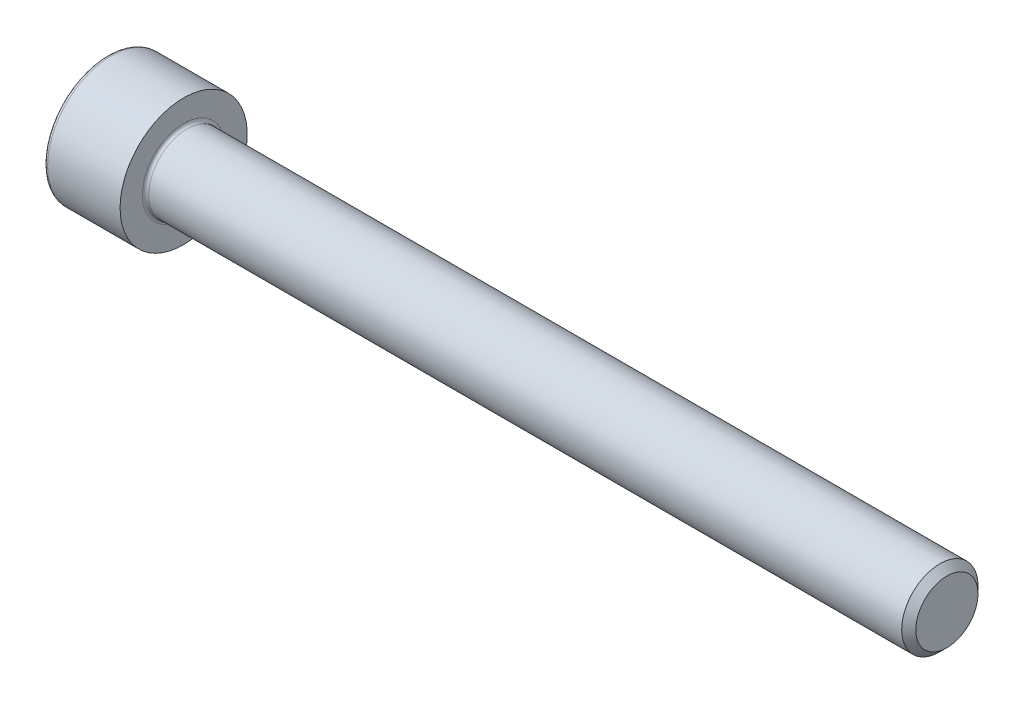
from build123d import *

# Parameters (mm, degrees)
FILLET1_R   = 0.25
FILLET2_R   = 0.3
HEX_2_DEPTH = 3


with BuildPart() as part:
    # BodySke → Base-Revolve (revolve)
    with BuildSketch(Plane.XY, mode=Mode.PRIVATE) as base_revolve_sk:
        Polygon((0, 0), (0, 5), (6, 5), (6, 3), (65.4455, 3), (66, 2.4455), (66, 0), align=None)
    revolve(base_revolve_sk.sketch.rotate(Axis((-31.75, 0, 0), (1, 0, 0)), 90), axis=Axis((-31.75, 0, 0), (1, 0, 0)))

    # Fillet1
    fillet1_edges = [part.edges().sort_by_distance(p)[0] for p in [
        (6, 0, -3),
    ]]
    fillet(fillet1_edges, radius=FILLET1_R)

    # Fillet2
    fillet2_edges = [part.edges().sort_by_distance(p)[0] for p in [
        (0, 0, -5),
    ]]
    fillet(fillet2_edges, radius=FILLET2_R)

    # Sketch2 → Hex-PreBroach (revolve, cut)
    with BuildSketch(Plane.XY, mode=Mode.PRIVATE) as hex_prebroach_sk:
        Polygon((0, 2.542), (3, 2.542), (4.467624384, 0), (0, 0), align=None)
    revolve(hex_prebroach_sk.sketch.rotate(Axis((0, 0, 0), (1, 0, 0)), 90), axis=Axis((0, 0, 0), (1, 0, 0)), mode=Mode.SUBTRACT)

    # Sketch3 → Hex 2 (cut)
    with BuildSketch(Plane(origin=(0, 0, 0), x_dir=(0, 0.500000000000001, 0.866025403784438), z_dir=(-1, 0, 0))):
        Polygon((1.467624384, 2.542), (-1.467624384, 2.542), (-2.935248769, 0), (-1.467624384, -2.542), (1.467624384, -2.542), (2.935248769, 0), align=None)
    extrude(amount=-HEX_2_DEPTH, mode=Mode.SUBTRACT)


solid = part.part
